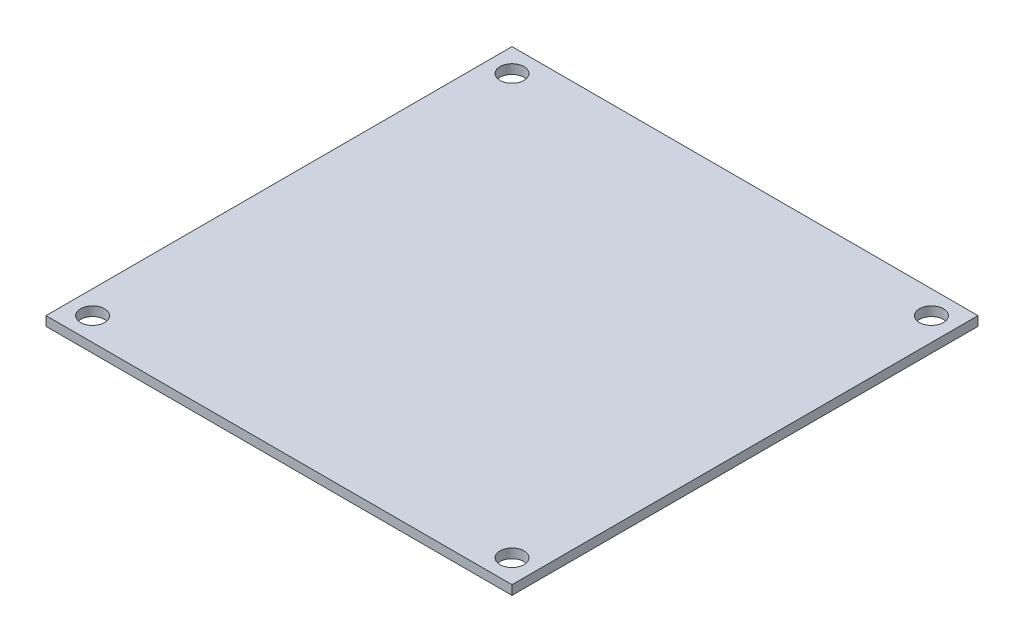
ISO-10303-21;
HEADER;
FILE_DESCRIPTION(('STEP AP214'),'2;1');
FILE_NAME('part.step','',(''),(''),'','','');
FILE_SCHEMA(('AUTOMOTIVE_DESIGN { 1 0 10303 214 1 1 1 1 }'));
ENDSEC;
DATA;
#1=APPLICATION_CONTEXT('core data for automotive mechanical design processes');
#2=APPLICATION_PROTOCOL_DEFINITION('international standard','automotive_design',2000,#1);
#3=PRODUCT_CONTEXT('',#1,'mechanical');
#4=PRODUCT('Part','Part','',(#3));
#5=PRODUCT_RELATED_PRODUCT_CATEGORY('part','',(#4));
#6=PRODUCT_DEFINITION_FORMATION('','',#4);
#7=PRODUCT_DEFINITION_CONTEXT('part definition',#1,'design');
#8=PRODUCT_DEFINITION('design','',#6,#7);
#9=PRODUCT_DEFINITION_SHAPE('','',#8);
#10=(LENGTH_UNIT() NAMED_UNIT(*) SI_UNIT(.MILLI.,.METRE.));
#11=(NAMED_UNIT(*) PLANE_ANGLE_UNIT() SI_UNIT($,.RADIAN.));
#12=(NAMED_UNIT(*) SI_UNIT($,.STERADIAN.) SOLID_ANGLE_UNIT());
#13=UNCERTAINTY_MEASURE_WITH_UNIT(LENGTH_MEASURE(1.E-05),#10,'distance_accuracy_value','');
#14=(GEOMETRIC_REPRESENTATION_CONTEXT(3) GLOBAL_UNCERTAINTY_ASSIGNED_CONTEXT((#13)) GLOBAL_UNIT_ASSIGNED_CONTEXT((#10,
#11,#12)) REPRESENTATION_CONTEXT('',''));
#15=CARTESIAN_POINT('',(0.,0.,0.));
#16=DIRECTION('',(0.,0.,1.));
#17=DIRECTION('',(1.,0.,0.));
#18=AXIS2_PLACEMENT_3D('',#15,#16,#17);
#19=CARTESIAN_POINT('',(0.,-1.27,0.));
#20=DIRECTION('',(-1.,0.,0.));
#21=DIRECTION('',(0.,0.,1.));
#22=AXIS2_PLACEMENT_3D('',#19,#20,#21);
#23=PLANE('',#22);
#24=DIRECTION('',(0.,0.,1.));
#25=VECTOR('',#24,1.);
#26=CARTESIAN_POINT('',(0.,0.,0.));
#27=LINE('',#26,#25);
#28=CARTESIAN_POINT('',(0.,0.,-63.5));
#29=VERTEX_POINT('',#28);
#30=CARTESIAN_POINT('',(0.,0.,0.));
#31=VERTEX_POINT('',#30);
#32=EDGE_CURVE('E99',#29,#31,#27,.T.);
#33=ORIENTED_EDGE('',*,*,#32,.F.);
#34=DIRECTION('',(0.,1.,0.));
#35=VECTOR('',#34,1.);
#36=CARTESIAN_POINT('',(0.,-1.27,-63.5));
#37=LINE('',#36,#35);
#38=CARTESIAN_POINT('',(0.,-1.27,-63.5));
#39=VERTEX_POINT('',#38);
#40=EDGE_CURVE('E11',#39,#29,#37,.T.);
#41=ORIENTED_EDGE('',*,*,#40,.F.);
#42=DIRECTION('',(0.,0.,1.));
#43=VECTOR('',#42,1.);
#44=CARTESIAN_POINT('',(0.,-1.27,0.));
#45=LINE('',#44,#43);
#46=CARTESIAN_POINT('',(0.,-1.27,0.));
#47=VERTEX_POINT('',#46);
#48=EDGE_CURVE('E92',#39,#47,#45,.T.);
#49=ORIENTED_EDGE('',*,*,#48,.T.);
#50=DIRECTION('',(0.,1.,0.));
#51=VECTOR('',#50,1.);
#52=CARTESIAN_POINT('',(0.,-1.27,0.));
#53=LINE('',#52,#51);
#54=EDGE_CURVE('E37',#47,#31,#53,.T.);
#55=ORIENTED_EDGE('',*,*,#54,.T.);
#56=EDGE_LOOP('',(#33,#41,#49,#55));
#57=FACE_BOUND('',#56,.T.);
#58=ADVANCED_FACE('F34',(#57),#23,.T.);
#59=CARTESIAN_POINT('',(0.,-1.27,-63.5));
#60=DIRECTION('',(0.,0.,-1.));
#61=DIRECTION('',(-1.,0.,0.));
#62=AXIS2_PLACEMENT_3D('',#59,#60,#61);
#63=PLANE('',#62);
#64=DIRECTION('',(-1.,0.,0.));
#65=VECTOR('',#64,1.);
#66=CARTESIAN_POINT('',(0.,0.,-63.5));
#67=LINE('',#66,#65);
#68=CARTESIAN_POINT('',(63.5,0.,-63.5));
#69=VERTEX_POINT('',#68);
#70=EDGE_CURVE('E94',#69,#29,#67,.T.);
#71=ORIENTED_EDGE('',*,*,#70,.F.);
#72=DIRECTION('',(0.,1.,0.));
#73=VECTOR('',#72,1.);
#74=CARTESIAN_POINT('',(63.5,-1.27,-63.5));
#75=LINE('',#74,#73);
#76=CARTESIAN_POINT('',(63.5,-1.27,-63.5));
#77=VERTEX_POINT('',#76);
#78=EDGE_CURVE('E43',#77,#69,#75,.T.);
#79=ORIENTED_EDGE('',*,*,#78,.F.);
#80=DIRECTION('',(-1.,0.,0.));
#81=VECTOR('',#80,1.);
#82=CARTESIAN_POINT('',(0.,-1.27,-63.5));
#83=LINE('',#82,#81);
#84=EDGE_CURVE('E89',#77,#39,#83,.T.);
#85=ORIENTED_EDGE('',*,*,#84,.T.);
#86=ORIENTED_EDGE('',*,*,#40,.T.);
#87=EDGE_LOOP('',(#71,#79,#85,#86));
#88=FACE_BOUND('',#87,.T.);
#89=ADVANCED_FACE('F110',(#88),#63,.T.);
#90=CARTESIAN_POINT('',(63.5,-1.27,0.));
#91=DIRECTION('',(1.,0.,0.));
#92=DIRECTION('',(0.,0.,-1.));
#93=AXIS2_PLACEMENT_3D('',#90,#91,#92);
#94=PLANE('',#93);
#95=DIRECTION('',(0.,0.,-1.));
#96=VECTOR('',#95,1.);
#97=CARTESIAN_POINT('',(63.5,0.,0.));
#98=LINE('',#97,#96);
#99=CARTESIAN_POINT('',(63.5,0.,0.));
#100=VERTEX_POINT('',#99);
#101=EDGE_CURVE('E84',#100,#69,#98,.T.);
#102=ORIENTED_EDGE('',*,*,#101,.F.);
#103=DIRECTION('',(0.,1.,0.));
#104=VECTOR('',#103,1.);
#105=CARTESIAN_POINT('',(63.5,-1.27,0.));
#106=LINE('',#105,#104);
#107=CARTESIAN_POINT('',(63.5,-1.27,0.));
#108=VERTEX_POINT('',#107);
#109=EDGE_CURVE('E79',#108,#100,#106,.T.);
#110=ORIENTED_EDGE('',*,*,#109,.F.);
#111=DIRECTION('',(0.,0.,-1.));
#112=VECTOR('',#111,1.);
#113=CARTESIAN_POINT('',(63.5,-1.27,0.));
#114=LINE('',#113,#112);
#115=EDGE_CURVE('E82',#108,#77,#114,.T.);
#116=ORIENTED_EDGE('',*,*,#115,.T.);
#117=ORIENTED_EDGE('',*,*,#78,.T.);
#118=EDGE_LOOP('',(#102,#110,#116,#117));
#119=FACE_BOUND('',#118,.T.);
#120=ADVANCED_FACE('F81',(#119),#94,.T.);
#121=CARTESIAN_POINT('',(0.,-1.27,0.));
#122=DIRECTION('',(0.,0.,1.));
#123=DIRECTION('',(1.,0.,0.));
#124=AXIS2_PLACEMENT_3D('',#121,#122,#123);
#125=PLANE('',#124);
#126=DIRECTION('',(1.,0.,0.));
#127=VECTOR('',#126,1.);
#128=CARTESIAN_POINT('',(0.,0.,0.));
#129=LINE('',#128,#127);
#130=EDGE_CURVE('E102',#31,#100,#129,.T.);
#131=ORIENTED_EDGE('',*,*,#130,.F.);
#132=ORIENTED_EDGE('',*,*,#54,.F.);
#133=DIRECTION('',(1.,0.,0.));
#134=VECTOR('',#133,1.);
#135=CARTESIAN_POINT('',(0.,-1.27,0.));
#136=LINE('',#135,#134);
#137=EDGE_CURVE('E88',#47,#108,#136,.T.);
#138=ORIENTED_EDGE('',*,*,#137,.T.);
#139=ORIENTED_EDGE('',*,*,#109,.T.);
#140=EDGE_LOOP('',(#131,#132,#138,#139));
#141=FACE_BOUND('',#140,.T.);
#142=ADVANCED_FACE('F91',(#141),#125,.T.);
#143=CARTESIAN_POINT('',(0.,-1.27,-63.5));
#144=DIRECTION('',(0.,-1.,0.));
#145=DIRECTION('',(0.,0.,-1.));
#146=AXIS2_PLACEMENT_3D('',#143,#144,#145);
#147=PLANE('',#146);
#148=CARTESIAN_POINT('',(60.325,-1.27,-60.3250000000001));
#149=DIRECTION('',(0.,-1.,0.));
#150=DIRECTION('',(0.,0.,-1.));
#151=AXIS2_PLACEMENT_3D('',#148,#149,#150);
#152=CIRCLE('',#151,1.63194999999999);
#153=CARTESIAN_POINT('',(60.325,-1.27,-61.9569500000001));
#154=VERTEX_POINT('',#153);
#155=EDGE_CURVE('E151',#154,#154,#152,.T.);
#156=ORIENTED_EDGE('',*,*,#155,.F.);
#157=EDGE_LOOP('',(#156));
#158=FACE_BOUND('',#157,.T.);
#159=CARTESIAN_POINT('',(3.17500000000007,-1.27,-3.175));
#160=DIRECTION('',(0.,-1.,0.));
#161=DIRECTION('',(0.,0.,-1.));
#162=AXIS2_PLACEMENT_3D('',#159,#160,#161);
#163=CIRCLE('',#162,1.63194999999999);
#164=CARTESIAN_POINT('',(3.17500000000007,-1.27,-4.80694999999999));
#165=VERTEX_POINT('',#164);
#166=EDGE_CURVE('E161',#165,#165,#163,.T.);
#167=ORIENTED_EDGE('',*,*,#166,.F.);
#168=EDGE_LOOP('',(#167));
#169=FACE_BOUND('',#168,.T.);
#170=CARTESIAN_POINT('',(60.3250000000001,-1.27,-3.17500000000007));
#171=DIRECTION('',(0.,-1.,0.));
#172=DIRECTION('',(0.,0.,-1.));
#173=AXIS2_PLACEMENT_3D('',#170,#171,#172);
#174=CIRCLE('',#173,1.63194999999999);
#175=CARTESIAN_POINT('',(60.3250000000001,-1.27,-4.80695000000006));
#176=VERTEX_POINT('',#175);
#177=EDGE_CURVE('E167',#176,#176,#174,.T.);
#178=ORIENTED_EDGE('',*,*,#177,.F.);
#179=EDGE_LOOP('',(#178));
#180=FACE_BOUND('',#179,.T.);
#181=CARTESIAN_POINT('',(3.175,-1.27,-60.325));
#182=DIRECTION('',(0.,-1.,0.));
#183=DIRECTION('',(0.,0.,-1.));
#184=AXIS2_PLACEMENT_3D('',#181,#182,#183);
#185=CIRCLE('',#184,1.63194999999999);
#186=CARTESIAN_POINT('',(3.175,-1.27,-61.95695));
#187=VERTEX_POINT('',#186);
#188=EDGE_CURVE('E103',#187,#187,#185,.T.);
#189=ORIENTED_EDGE('',*,*,#188,.F.);
#190=EDGE_LOOP('',(#189));
#191=FACE_BOUND('',#190,.T.);
#192=ORIENTED_EDGE('',*,*,#48,.F.);
#193=ORIENTED_EDGE('',*,*,#84,.F.);
#194=ORIENTED_EDGE('',*,*,#115,.F.);
#195=ORIENTED_EDGE('',*,*,#137,.F.);
#196=EDGE_LOOP('',(#192,#193,#194,#195));
#197=FACE_BOUND('',#196,.T.);
#198=ADVANCED_FACE('F87',(#158,#169,#180,#191,#197),#147,.T.);
#199=CARTESIAN_POINT('',(0.,0.,-63.5));
#200=DIRECTION('',(0.,-1.,0.));
#201=DIRECTION('',(0.,0.,-1.));
#202=AXIS2_PLACEMENT_3D('',#199,#200,#201);
#203=PLANE('',#202);
#204=CARTESIAN_POINT('',(60.325,0.,-60.3250000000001));
#205=DIRECTION('',(0.,1.,0.));
#206=DIRECTION('',(0.,0.,1.));
#207=AXIS2_PLACEMENT_3D('',#204,#205,#206);
#208=CIRCLE('',#207,1.63194999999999);
#209=CARTESIAN_POINT('',(60.325,0.,-58.6930500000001));
#210=VERTEX_POINT('',#209);
#211=EDGE_CURVE('E154',#210,#210,#208,.T.);
#212=ORIENTED_EDGE('',*,*,#211,.F.);
#213=EDGE_LOOP('',(#212));
#214=FACE_BOUND('',#213,.T.);
#215=CARTESIAN_POINT('',(3.17500000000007,0.,-3.175));
#216=DIRECTION('',(0.,1.,0.));
#217=DIRECTION('',(0.,0.,1.));
#218=AXIS2_PLACEMENT_3D('',#215,#216,#217);
#219=CIRCLE('',#218,1.63194999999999);
#220=CARTESIAN_POINT('',(3.17500000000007,0.,-1.54305000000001));
#221=VERTEX_POINT('',#220);
#222=EDGE_CURVE('E156',#221,#221,#219,.T.);
#223=ORIENTED_EDGE('',*,*,#222,.F.);
#224=EDGE_LOOP('',(#223));
#225=FACE_BOUND('',#224,.T.);
#226=CARTESIAN_POINT('',(60.3250000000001,0.,-3.17500000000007));
#227=DIRECTION('',(0.,1.,0.));
#228=DIRECTION('',(0.,0.,1.));
#229=AXIS2_PLACEMENT_3D('',#226,#227,#228);
#230=CIRCLE('',#229,1.63194999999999);
#231=CARTESIAN_POINT('',(60.3250000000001,0.,-1.54305000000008));
#232=VERTEX_POINT('',#231);
#233=EDGE_CURVE('E164',#232,#232,#230,.T.);
#234=ORIENTED_EDGE('',*,*,#233,.F.);
#235=EDGE_LOOP('',(#234));
#236=FACE_BOUND('',#235,.T.);
#237=CARTESIAN_POINT('',(3.175,0.,-60.325));
#238=DIRECTION('',(0.,1.,0.));
#239=DIRECTION('',(0.,0.,1.));
#240=AXIS2_PLACEMENT_3D('',#237,#238,#239);
#241=CIRCLE('',#240,1.63194999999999);
#242=CARTESIAN_POINT('',(3.175,0.,-58.69305));
#243=VERTEX_POINT('',#242);
#244=EDGE_CURVE('E170',#243,#243,#241,.T.);
#245=ORIENTED_EDGE('',*,*,#244,.F.);
#246=EDGE_LOOP('',(#245));
#247=FACE_BOUND('',#246,.T.);
#248=ORIENTED_EDGE('',*,*,#32,.T.);
#249=ORIENTED_EDGE('',*,*,#130,.T.);
#250=ORIENTED_EDGE('',*,*,#101,.T.);
#251=ORIENTED_EDGE('',*,*,#70,.T.);
#252=EDGE_LOOP('',(#248,#249,#250,#251));
#253=FACE_BOUND('',#252,.T.);
#254=ADVANCED_FACE('F109',(#214,#225,#236,#247,#253),#203,.F.);
#255=CARTESIAN_POINT('',(3.175,0.,-60.325));
#256=DIRECTION('',(0.,1.,0.));
#257=DIRECTION('',(0.,0.,1.));
#258=AXIS2_PLACEMENT_3D('',#255,#256,#257);
#259=CYLINDRICAL_SURFACE('',#258,1.63194999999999);
#260=ORIENTED_EDGE('',*,*,#188,.T.);
#261=EDGE_LOOP('',(#260));
#262=FACE_BOUND('',#261,.T.);
#263=ORIENTED_EDGE('',*,*,#244,.T.);
#264=EDGE_LOOP('',(#263));
#265=FACE_BOUND('',#264,.T.);
#266=ADVANCED_FACE('F128',(#262,#265),#259,.F.);
#267=CARTESIAN_POINT('',(60.3250000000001,0.,-3.17500000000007));
#268=DIRECTION('',(0.,1.,0.));
#269=DIRECTION('',(0.,0.,1.));
#270=AXIS2_PLACEMENT_3D('',#267,#268,#269);
#271=CYLINDRICAL_SURFACE('',#270,1.63194999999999);
#272=ORIENTED_EDGE('',*,*,#177,.T.);
#273=EDGE_LOOP('',(#272));
#274=FACE_BOUND('',#273,.T.);
#275=ORIENTED_EDGE('',*,*,#233,.T.);
#276=EDGE_LOOP('',(#275));
#277=FACE_BOUND('',#276,.T.);
#278=ADVANCED_FACE('F135',(#274,#277),#271,.F.);
#279=CARTESIAN_POINT('',(3.17500000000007,0.,-3.175));
#280=DIRECTION('',(0.,1.,0.));
#281=DIRECTION('',(0.,0.,1.));
#282=AXIS2_PLACEMENT_3D('',#279,#280,#281);
#283=CYLINDRICAL_SURFACE('',#282,1.63194999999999);
#284=ORIENTED_EDGE('',*,*,#166,.T.);
#285=EDGE_LOOP('',(#284));
#286=FACE_BOUND('',#285,.T.);
#287=ORIENTED_EDGE('',*,*,#222,.T.);
#288=EDGE_LOOP('',(#287));
#289=FACE_BOUND('',#288,.T.);
#290=ADVANCED_FACE('F139',(#286,#289),#283,.F.);
#291=CARTESIAN_POINT('',(60.325,0.,-60.3250000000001));
#292=DIRECTION('',(0.,1.,0.));
#293=DIRECTION('',(0.,0.,1.));
#294=AXIS2_PLACEMENT_3D('',#291,#292,#293);
#295=CYLINDRICAL_SURFACE('',#294,1.63194999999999);
#296=ORIENTED_EDGE('',*,*,#155,.T.);
#297=EDGE_LOOP('',(#296));
#298=FACE_BOUND('',#297,.T.);
#299=ORIENTED_EDGE('',*,*,#211,.T.);
#300=EDGE_LOOP('',(#299));
#301=FACE_BOUND('',#300,.T.);
#302=ADVANCED_FACE('F143',(#298,#301),#295,.F.);
#303=CLOSED_SHELL('',(#58,#89,#120,#142,#198,#254,#266,#278,#290,#302));
#304=MANIFOLD_SOLID_BREP('B2',#303);
#305=ADVANCED_BREP_SHAPE_REPRESENTATION('',(#18,#304),#14);
#306=SHAPE_DEFINITION_REPRESENTATION(#9,#305);
ENDSEC;
END-ISO-10303-21;
